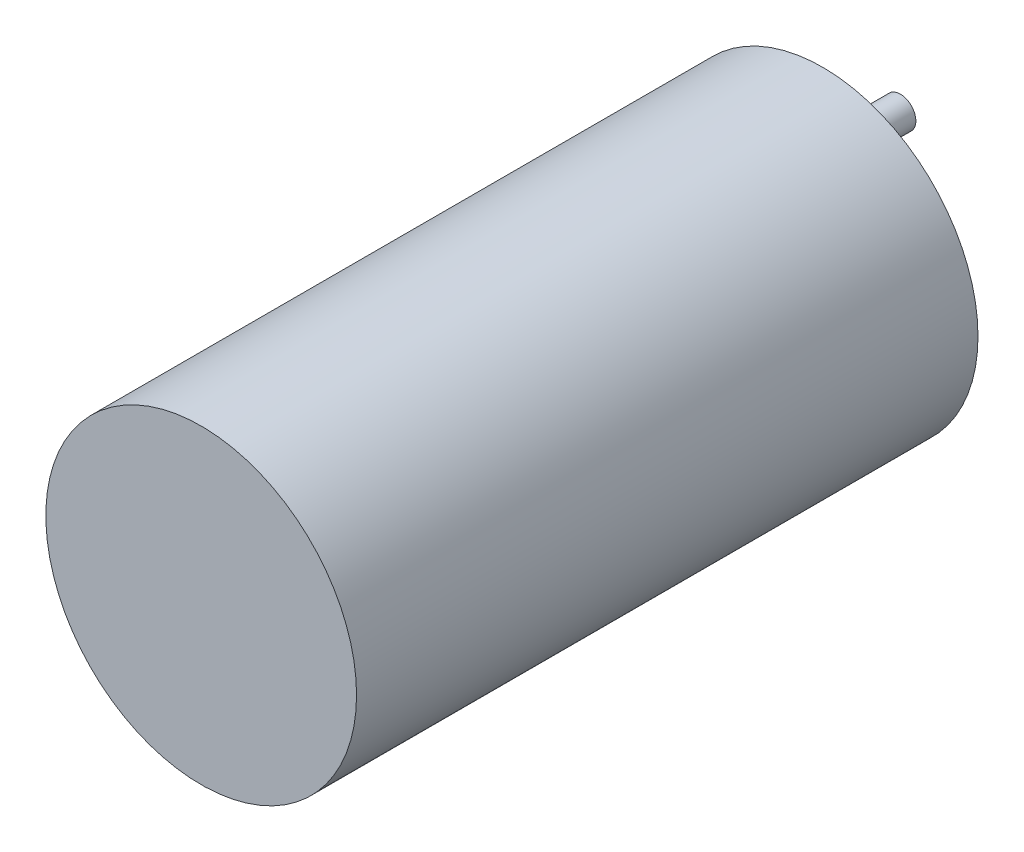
ISO-10303-21;
HEADER;
FILE_DESCRIPTION(('STEP AP214'),'2;1');
FILE_NAME('part.step','',(''),(''),'','','');
FILE_SCHEMA(('AUTOMOTIVE_DESIGN { 1 0 10303 214 1 1 1 1 }'));
ENDSEC;
DATA;
#1=APPLICATION_CONTEXT('core data for automotive mechanical design processes');
#2=APPLICATION_PROTOCOL_DEFINITION('international standard','automotive_design',2000,#1);
#3=PRODUCT_CONTEXT('',#1,'mechanical');
#4=PRODUCT('Part','Part','',(#3));
#5=PRODUCT_RELATED_PRODUCT_CATEGORY('part','',(#4));
#6=PRODUCT_DEFINITION_FORMATION('','',#4);
#7=PRODUCT_DEFINITION_CONTEXT('part definition',#1,'design');
#8=PRODUCT_DEFINITION('design','',#6,#7);
#9=PRODUCT_DEFINITION_SHAPE('','',#8);
#10=(LENGTH_UNIT() NAMED_UNIT(*) SI_UNIT(.MILLI.,.METRE.));
#11=(NAMED_UNIT(*) PLANE_ANGLE_UNIT() SI_UNIT($,.RADIAN.));
#12=(NAMED_UNIT(*) SI_UNIT($,.STERADIAN.) SOLID_ANGLE_UNIT());
#13=UNCERTAINTY_MEASURE_WITH_UNIT(LENGTH_MEASURE(1.E-05),#10,'distance_accuracy_value','');
#14=(GEOMETRIC_REPRESENTATION_CONTEXT(3) GLOBAL_UNCERTAINTY_ASSIGNED_CONTEXT((#13)) GLOBAL_UNIT_ASSIGNED_CONTEXT((#10,
#11,#12)) REPRESENTATION_CONTEXT('',''));
#15=CARTESIAN_POINT('',(0.,0.,0.));
#16=DIRECTION('',(0.,0.,1.));
#17=DIRECTION('',(1.,0.,0.));
#18=AXIS2_PLACEMENT_3D('',#15,#16,#17);
#19=CARTESIAN_POINT('',(0.,0.,0.));
#20=DIRECTION('',(0.,0.,1.));
#21=DIRECTION('',(1.,0.,0.));
#22=AXIS2_PLACEMENT_3D('',#19,#20,#21);
#23=PLANE('',#22);
#24=CARTESIAN_POINT('',(0.,2.54,0.));
#25=DIRECTION('',(0.,0.,1.));
#26=DIRECTION('',(1.,0.,0.));
#27=AXIS2_PLACEMENT_3D('',#24,#25,#26);
#28=CIRCLE('',#27,0.508);
#29=CARTESIAN_POINT('',(0.508,2.54,0.));
#30=VERTEX_POINT('',#29);
#31=EDGE_CURVE('E35',#30,#30,#28,.F.);
#32=ORIENTED_EDGE('',*,*,#31,.F.);
#33=EDGE_LOOP('',(#32));
#34=FACE_BOUND('',#33,.T.);
#35=CARTESIAN_POINT('',(0.,0.,0.));
#36=DIRECTION('',(0.,0.,1.));
#37=DIRECTION('',(1.,0.,0.));
#38=AXIS2_PLACEMENT_3D('',#35,#36,#37);
#39=CIRCLE('',#38,5.08);
#40=CARTESIAN_POINT('',(5.08,0.,0.));
#41=VERTEX_POINT('',#40);
#42=EDGE_CURVE('E43',#41,#41,#39,.T.);
#43=ORIENTED_EDGE('',*,*,#42,.F.);
#44=EDGE_LOOP('',(#43));
#45=FACE_BOUND('',#44,.T.);
#46=CARTESIAN_POINT('',(0.,-2.54,0.));
#47=DIRECTION('',(0.,0.,1.));
#48=DIRECTION('',(1.,0.,0.));
#49=AXIS2_PLACEMENT_3D('',#46,#47,#48);
#50=CIRCLE('',#49,0.508);
#51=CARTESIAN_POINT('',(0.508,-2.54,0.));
#52=VERTEX_POINT('',#51);
#53=EDGE_CURVE('E10',#52,#52,#50,.F.);
#54=ORIENTED_EDGE('',*,*,#53,.F.);
#55=EDGE_LOOP('',(#54));
#56=FACE_BOUND('',#55,.T.);
#57=ADVANCED_FACE('F28',(#34,#45,#56),#23,.F.);
#58=CARTESIAN_POINT('',(0.,0.,20.32));
#59=DIRECTION('',(0.,0.,-1.));
#60=DIRECTION('',(-1.,0.,0.));
#61=AXIS2_PLACEMENT_3D('',#58,#59,#60);
#62=CYLINDRICAL_SURFACE('',#61,5.08);
#63=CARTESIAN_POINT('',(0.,0.,20.32));
#64=DIRECTION('',(0.,0.,1.));
#65=DIRECTION('',(1.,0.,0.));
#66=AXIS2_PLACEMENT_3D('',#63,#64,#65);
#67=CIRCLE('',#66,5.08);
#68=CARTESIAN_POINT('',(5.08,0.,20.32));
#69=VERTEX_POINT('',#68);
#70=EDGE_CURVE('E39',#69,#69,#67,.T.);
#71=ORIENTED_EDGE('',*,*,#70,.F.);
#72=EDGE_LOOP('',(#71));
#73=FACE_BOUND('',#72,.T.);
#74=ORIENTED_EDGE('',*,*,#42,.T.);
#75=EDGE_LOOP('',(#74));
#76=FACE_BOUND('',#75,.T.);
#77=ADVANCED_FACE('F30',(#73,#76),#62,.T.);
#78=CARTESIAN_POINT('',(0.,0.,20.32));
#79=DIRECTION('',(0.,0.,1.));
#80=DIRECTION('',(1.,0.,0.));
#81=AXIS2_PLACEMENT_3D('',#78,#79,#80);
#82=PLANE('',#81);
#83=ORIENTED_EDGE('',*,*,#70,.T.);
#84=EDGE_LOOP('',(#83));
#85=FACE_BOUND('',#84,.T.);
#86=ADVANCED_FACE('F74',(#85),#82,.T.);
#87=CARTESIAN_POINT('',(0.,2.54,-2.54));
#88=DIRECTION('',(0.,0.,1.));
#89=DIRECTION('',(1.,0.,0.));
#90=AXIS2_PLACEMENT_3D('',#87,#88,#89);
#91=CYLINDRICAL_SURFACE('',#90,0.508);
#92=CARTESIAN_POINT('',(0.,2.54,-2.54));
#93=DIRECTION('',(0.,0.,-1.));
#94=DIRECTION('',(-1.,0.,0.));
#95=AXIS2_PLACEMENT_3D('',#92,#93,#94);
#96=CIRCLE('',#95,0.508);
#97=CARTESIAN_POINT('',(-0.508,2.54,-2.54));
#98=VERTEX_POINT('',#97);
#99=EDGE_CURVE('E47',#98,#98,#96,.T.);
#100=ORIENTED_EDGE('',*,*,#99,.F.);
#101=EDGE_LOOP('',(#100));
#102=FACE_BOUND('',#101,.T.);
#103=ORIENTED_EDGE('',*,*,#31,.T.);
#104=EDGE_LOOP('',(#103));
#105=FACE_BOUND('',#104,.T.);
#106=ADVANCED_FACE('F66',(#102,#105),#91,.T.);
#107=CARTESIAN_POINT('',(0.,2.54,-2.54));
#108=DIRECTION('',(0.,0.,-1.));
#109=DIRECTION('',(-1.,0.,0.));
#110=AXIS2_PLACEMENT_3D('',#107,#108,#109);
#111=PLANE('',#110);
#112=ORIENTED_EDGE('',*,*,#99,.T.);
#113=EDGE_LOOP('',(#112));
#114=FACE_BOUND('',#113,.T.);
#115=ADVANCED_FACE('F59',(#114),#111,.T.);
#116=CARTESIAN_POINT('',(0.,-2.54,-2.54));
#117=DIRECTION('',(0.,0.,1.));
#118=DIRECTION('',(1.,0.,0.));
#119=AXIS2_PLACEMENT_3D('',#116,#117,#118);
#120=CYLINDRICAL_SURFACE('',#119,0.508);
#121=CARTESIAN_POINT('',(0.,-2.54,-2.54));
#122=DIRECTION('',(0.,0.,-1.));
#123=DIRECTION('',(-1.,0.,0.));
#124=AXIS2_PLACEMENT_3D('',#121,#122,#123);
#125=CIRCLE('',#124,0.508);
#126=CARTESIAN_POINT('',(-0.508,-2.54,-2.54));
#127=VERTEX_POINT('',#126);
#128=EDGE_CURVE('E51',#127,#127,#125,.T.);
#129=ORIENTED_EDGE('',*,*,#128,.F.);
#130=EDGE_LOOP('',(#129));
#131=FACE_BOUND('',#130,.T.);
#132=ORIENTED_EDGE('',*,*,#53,.T.);
#133=EDGE_LOOP('',(#132));
#134=FACE_BOUND('',#133,.T.);
#135=ADVANCED_FACE('F57',(#131,#134),#120,.T.);
#136=CARTESIAN_POINT('',(0.,-2.54,-2.54));
#137=DIRECTION('',(0.,0.,-1.));
#138=DIRECTION('',(-1.,0.,0.));
#139=AXIS2_PLACEMENT_3D('',#136,#137,#138);
#140=PLANE('',#139);
#141=ORIENTED_EDGE('',*,*,#128,.T.);
#142=EDGE_LOOP('',(#141));
#143=FACE_BOUND('',#142,.T.);
#144=ADVANCED_FACE('F55',(#143),#140,.T.);
#145=CLOSED_SHELL('',(#57,#77,#86,#106,#115,#135,#144));
#146=MANIFOLD_SOLID_BREP('B2',#145);
#147=ADVANCED_BREP_SHAPE_REPRESENTATION('',(#18,#146),#14);
#148=SHAPE_DEFINITION_REPRESENTATION(#9,#147);
ENDSEC;
END-ISO-10303-21;
